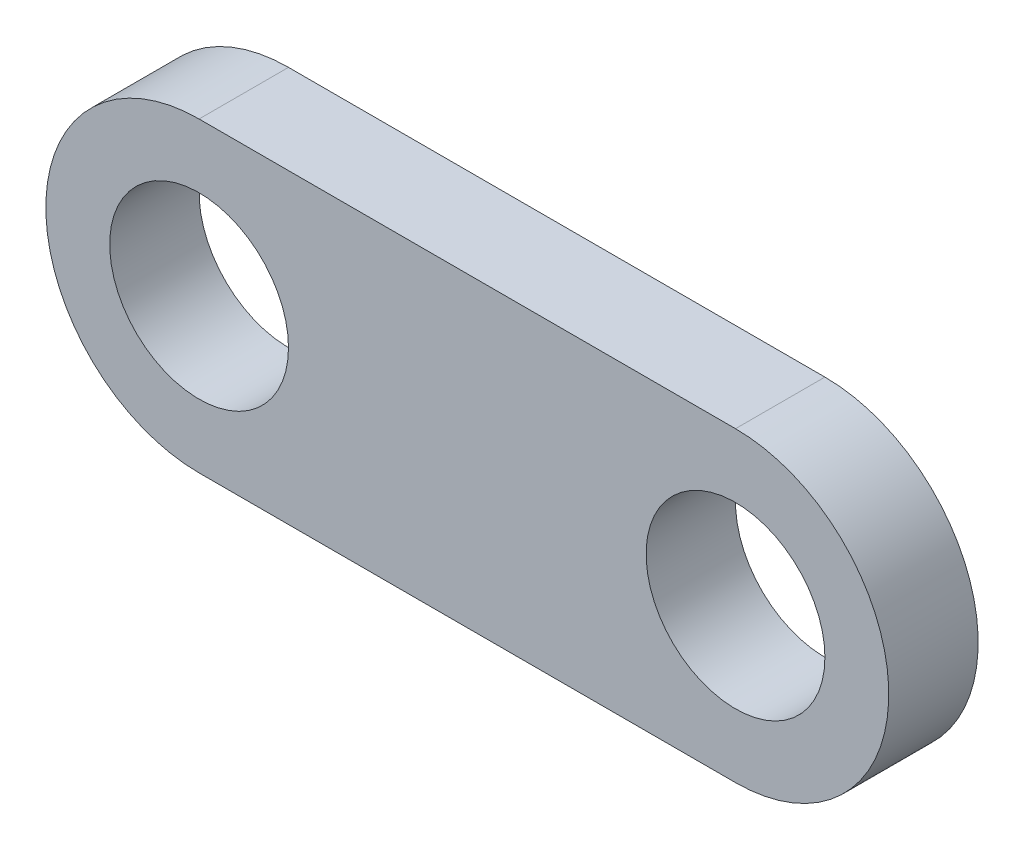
from build123d import *

# Parameters (mm, degrees)
ESQUISSE1_R      = 7
EXTRUSION1_DEPTH = 7


with BuildPart() as part:
    # Esquisse1 → Extrusion1 (new body)
    with BuildSketch(Plane(origin=(0, 0, 0), x_dir=(-1, 0, 0), z_dir=(0, 0, -1))):
        with BuildLine():
            Line((0, 12), (-42, 12))
            ThreePointArc((-42, 12), (-54, 0), (-42, -12))
            Line((-42, -12), (0, -12))
            ThreePointArc((0, -12), (12, 0), (0, 12))
        make_face()
        with Locations(Location((-42, 0, 0), (0, 0, 180))):
            Circle(ESQUISSE1_R, mode=Mode.SUBTRACT)
        with Locations(Location((0, 0, 0), (0, 0, 180))):
            Circle(ESQUISSE1_R, mode=Mode.SUBTRACT)
    extrude(amount=-EXTRUSION1_DEPTH)


solid = part.part
